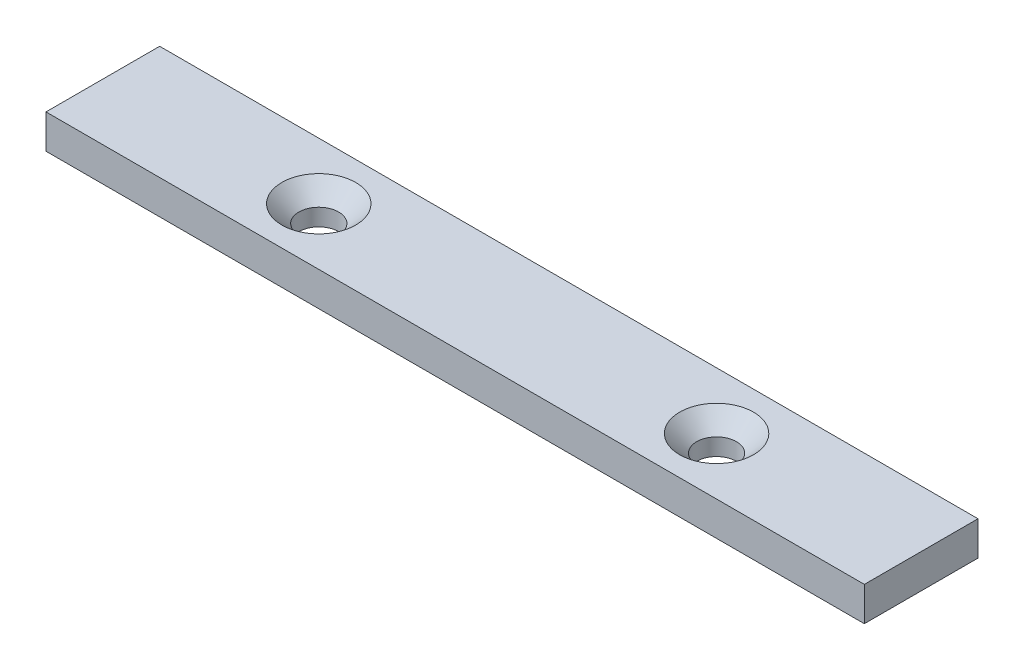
from build123d import *

# Parameters (mm, degrees)
SKETCH1_W       = 144
SKETCH1_H       = 20
EXTRUDE1_DEPTH  = 6
LPATTERN1_COUNT = 2
LPATTERN1_PITCH = 70


with BuildPart() as part:
    # Sketch1 → Extrude1 (new body)
    with BuildSketch(Plane(origin=(0, 0, 0), x_dir=(1, 0, 0), z_dir=(0, 1, 0))):
        Rectangle(SKETCH1_W, SKETCH1_H)
    extrude(amount=EXTRUDE1_DEPTH)

    # Sketch2 → Cut-Revolve1 (revolve, cut)
    with BuildSketch(Plane.XY, mode=Mode.PRIVATE) as cut_revolve1_sk:
        Polygon((-40.5, 6), (-37.5, 3), (-37.5, 0), (-34, 0), (-34, 6), align=None)
    cut_revolve1 = revolve(cut_revolve1_sk.sketch.rotate(Axis((-34, 9.961178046, 0), (0, -1, 0)), 270), axis=Axis((-34, 9.961178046, 0), (0, -1, 0)), mode=Mode.SUBTRACT)

    # LPattern1: Cut-Revolve1 ×2
    with Locations(*[(i * LPATTERN1_PITCH, 0, 0) for i in range(1, LPATTERN1_COUNT)]):
        add(cut_revolve1, mode=Mode.SUBTRACT)


solid = part.part
